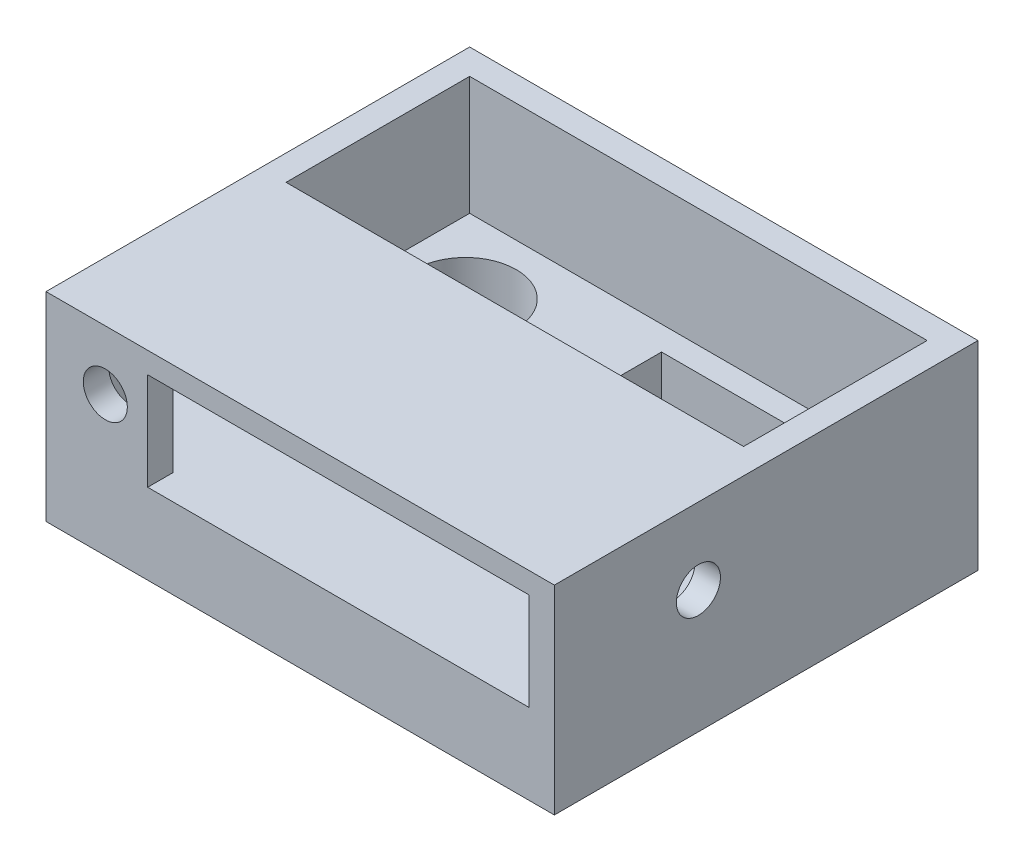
ISO-10303-21;
HEADER;
FILE_DESCRIPTION(('STEP AP214'),'2;1');
FILE_NAME('part.step','',(''),(''),'','','');
FILE_SCHEMA(('AUTOMOTIVE_DESIGN { 1 0 10303 214 1 1 1 1 }'));
ENDSEC;
DATA;
#1=APPLICATION_CONTEXT('core data for automotive mechanical design processes');
#2=APPLICATION_PROTOCOL_DEFINITION('international standard','automotive_design',2000,#1);
#3=PRODUCT_CONTEXT('',#1,'mechanical');
#4=PRODUCT('Part','Part','',(#3));
#5=PRODUCT_RELATED_PRODUCT_CATEGORY('part','',(#4));
#6=PRODUCT_DEFINITION_FORMATION('','',#4);
#7=PRODUCT_DEFINITION_CONTEXT('part definition',#1,'design');
#8=PRODUCT_DEFINITION('design','',#6,#7);
#9=PRODUCT_DEFINITION_SHAPE('','',#8);
#10=(LENGTH_UNIT() NAMED_UNIT(*) SI_UNIT(.MILLI.,.METRE.));
#11=(NAMED_UNIT(*) PLANE_ANGLE_UNIT() SI_UNIT($,.RADIAN.));
#12=(NAMED_UNIT(*) SI_UNIT($,.STERADIAN.) SOLID_ANGLE_UNIT());
#13=UNCERTAINTY_MEASURE_WITH_UNIT(LENGTH_MEASURE(1.E-05),#10,'distance_accuracy_value','');
#14=(GEOMETRIC_REPRESENTATION_CONTEXT(3) GLOBAL_UNCERTAINTY_ASSIGNED_CONTEXT((#13)) GLOBAL_UNIT_ASSIGNED_CONTEXT((#10,
#11,#12)) REPRESENTATION_CONTEXT('',''));
#15=CARTESIAN_POINT('',(0.,0.,0.));
#16=DIRECTION('',(0.,0.,1.));
#17=DIRECTION('',(1.,0.,0.));
#18=AXIS2_PLACEMENT_3D('',#15,#16,#17);
#19=CARTESIAN_POINT('',(0.,0.,0.));
#20=DIRECTION('',(0.,1.,0.));
#21=DIRECTION('',(0.,0.,1.));
#22=AXIS2_PLACEMENT_3D('',#19,#20,#21);
#23=PLANE('',#22);
#24=DIRECTION('',(0.,0.,-1.));
#25=VECTOR('',#24,1.);
#26=CARTESIAN_POINT('',(28.5,0.,5.85000000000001));
#27=LINE('',#26,#25);
#28=CARTESIAN_POINT('',(28.5,0.,18.15));
#29=VERTEX_POINT('',#28);
#30=CARTESIAN_POINT('',(28.5,0.,5.85000000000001));
#31=VERTEX_POINT('',#30);
#32=EDGE_CURVE('E347',#29,#31,#27,.T.);
#33=ORIENTED_EDGE('',*,*,#32,.F.);
#34=DIRECTION('',(-1.,0.,0.));
#35=VECTOR('',#34,1.);
#36=CARTESIAN_POINT('',(56.5,0.,18.15));
#37=LINE('',#36,#35);
#38=CARTESIAN_POINT('',(23.5,0.,18.15));
#39=VERTEX_POINT('',#38);
#40=EDGE_CURVE('E245',#29,#39,#37,.T.);
#41=ORIENTED_EDGE('',*,*,#40,.T.);
#42=DIRECTION('',(0.,0.,-1.));
#43=VECTOR('',#42,1.);
#44=CARTESIAN_POINT('',(23.5,0.,5.85000000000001));
#45=LINE('',#44,#43);
#46=CARTESIAN_POINT('',(23.5,0.,5.85000000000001));
#47=VERTEX_POINT('',#46);
#48=EDGE_CURVE('E257',#39,#47,#45,.T.);
#49=ORIENTED_EDGE('',*,*,#48,.T.);
#50=DIRECTION('',(1.,0.,0.));
#51=VECTOR('',#50,1.);
#52=CARTESIAN_POINT('',(56.5,0.,5.85000000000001));
#53=LINE('',#52,#51);
#54=EDGE_CURVE('E254',#47,#31,#53,.T.);
#55=ORIENTED_EDGE('',*,*,#54,.T.);
#56=EDGE_LOOP('',(#33,#41,#49,#55));
#57=FACE_BOUND('',#56,.T.);
#58=ADVANCED_FACE('F35',(#57),#23,.F.);
#59=CARTESIAN_POINT('',(0.,21.,0.));
#60=DIRECTION('',(1.,0.,0.));
#61=DIRECTION('',(0.,0.,-1.));
#62=AXIS2_PLACEMENT_3D('',#59,#60,#61);
#63=PLANE('',#62);
#64=DIRECTION('',(0.,-1.,0.));
#65=VECTOR('',#64,1.);
#66=CARTESIAN_POINT('',(0.,21.,50.));
#67=LINE('',#66,#65);
#68=CARTESIAN_POINT('',(0.,21.,50.));
#69=VERTEX_POINT('',#68);
#70=CARTESIAN_POINT('',(0.,-2.5,50.));
#71=VERTEX_POINT('',#70);
#72=EDGE_CURVE('E233',#69,#71,#67,.T.);
#73=ORIENTED_EDGE('',*,*,#72,.F.);
#74=DIRECTION('',(0.,0.,1.));
#75=VECTOR('',#74,1.);
#76=CARTESIAN_POINT('',(0.,21.,0.));
#77=LINE('',#76,#75);
#78=CARTESIAN_POINT('',(0.,21.,0.));
#79=VERTEX_POINT('',#78);
#80=EDGE_CURVE('E215',#79,#69,#77,.T.);
#81=ORIENTED_EDGE('',*,*,#80,.F.);
#82=DIRECTION('',(0.,-1.,0.));
#83=VECTOR('',#82,1.);
#84=CARTESIAN_POINT('',(0.,21.,0.));
#85=LINE('',#84,#83);
#86=CARTESIAN_POINT('',(0.,-2.5,0.));
#87=VERTEX_POINT('',#86);
#88=EDGE_CURVE('E227',#79,#87,#85,.T.);
#89=ORIENTED_EDGE('',*,*,#88,.T.);
#90=DIRECTION('',(0.,0.,-1.));
#91=VECTOR('',#90,1.);
#92=CARTESIAN_POINT('',(0.,-2.5,0.));
#93=LINE('',#92,#91);
#94=EDGE_CURVE('E339',#71,#87,#93,.T.);
#95=ORIENTED_EDGE('',*,*,#94,.F.);
#96=EDGE_LOOP('',(#73,#81,#89,#95));
#97=FACE_BOUND('',#96,.T.);
#98=ADVANCED_FACE('F37',(#97),#63,.F.);
#99=CARTESIAN_POINT('',(0.,21.,50.));
#100=DIRECTION('',(0.,0.,-1.));
#101=DIRECTION('',(-1.,0.,0.));
#102=AXIS2_PLACEMENT_3D('',#99,#100,#101);
#103=PLANE('',#102);
#104=DIRECTION('',(-1.,0.,0.));
#105=VECTOR('',#104,1.);
#106=CARTESIAN_POINT('',(57.,18.5,50.));
#107=LINE('',#106,#105);
#108=CARTESIAN_POINT('',(57.,18.5,50.));
#109=VERTEX_POINT('',#108);
#110=CARTESIAN_POINT('',(12.,18.5,50.));
#111=VERTEX_POINT('',#110);
#112=EDGE_CURVE('E289',#109,#111,#107,.T.);
#113=ORIENTED_EDGE('',*,*,#112,.F.);
#114=DIRECTION('',(0.,1.,0.));
#115=VECTOR('',#114,1.);
#116=CARTESIAN_POINT('',(57.,18.5,50.));
#117=LINE('',#116,#115);
#118=CARTESIAN_POINT('',(57.,7.,50.));
#119=VERTEX_POINT('',#118);
#120=EDGE_CURVE('E291',#119,#109,#117,.T.);
#121=ORIENTED_EDGE('',*,*,#120,.F.);
#122=DIRECTION('',(1.,0.,0.));
#123=VECTOR('',#122,1.);
#124=CARTESIAN_POINT('',(57.,7.,50.));
#125=LINE('',#124,#123);
#126=CARTESIAN_POINT('',(12.,7.,50.));
#127=VERTEX_POINT('',#126);
#128=EDGE_CURVE('E189',#127,#119,#125,.T.);
#129=ORIENTED_EDGE('',*,*,#128,.F.);
#130=DIRECTION('',(0.,-1.,0.));
#131=VECTOR('',#130,1.);
#132=CARTESIAN_POINT('',(12.,18.5,50.));
#133=LINE('',#132,#131);
#134=EDGE_CURVE('E173',#111,#127,#133,.T.);
#135=ORIENTED_EDGE('',*,*,#134,.F.);
#136=EDGE_LOOP('',(#113,#121,#129,#135));
#137=FACE_BOUND('',#136,.T.);
#138=CARTESIAN_POINT('',(7.00000000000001,14.,50.));
#139=DIRECTION('',(0.,0.,1.));
#140=DIRECTION('',(1.,0.,0.));
#141=AXIS2_PLACEMENT_3D('',#138,#139,#140);
#142=CIRCLE('',#141,2.6);
#143=CARTESIAN_POINT('',(9.60000000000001,14.,50.));
#144=VERTEX_POINT('',#143);
#145=EDGE_CURVE('E244',#144,#144,#142,.T.);
#146=ORIENTED_EDGE('',*,*,#145,.F.);
#147=EDGE_LOOP('',(#146));
#148=FACE_BOUND('',#147,.T.);
#149=DIRECTION('',(-1.,0.,0.));
#150=VECTOR('',#149,1.);
#151=CARTESIAN_POINT('',(60.,-2.5,50.));
#152=LINE('',#151,#150);
#153=CARTESIAN_POINT('',(60.,-2.5,50.));
#154=VERTEX_POINT('',#153);
#155=EDGE_CURVE('E337',#154,#71,#152,.T.);
#156=ORIENTED_EDGE('',*,*,#155,.F.);
#157=DIRECTION('',(0.,-1.,0.));
#158=VECTOR('',#157,1.);
#159=CARTESIAN_POINT('',(60.,21.,50.));
#160=LINE('',#159,#158);
#161=CARTESIAN_POINT('',(60.,21.,50.));
#162=VERTEX_POINT('',#161);
#163=EDGE_CURVE('E231',#162,#154,#160,.T.);
#164=ORIENTED_EDGE('',*,*,#163,.F.);
#165=DIRECTION('',(1.,0.,0.));
#166=VECTOR('',#165,1.);
#167=CARTESIAN_POINT('',(0.,21.,50.));
#168=LINE('',#167,#166);
#169=EDGE_CURVE('E221',#69,#162,#168,.T.);
#170=ORIENTED_EDGE('',*,*,#169,.F.);
#171=ORIENTED_EDGE('',*,*,#72,.T.);
#172=EDGE_LOOP('',(#156,#164,#170,#171));
#173=FACE_BOUND('',#172,.T.);
#174=ADVANCED_FACE('F400',(#137,#148,#173),#103,.F.);
#175=CARTESIAN_POINT('',(60.,21.,0.));
#176=DIRECTION('',(-1.,0.,0.));
#177=DIRECTION('',(0.,0.,1.));
#178=AXIS2_PLACEMENT_3D('',#175,#176,#177);
#179=PLANE('',#178);
#180=CARTESIAN_POINT('',(60.,12.,33.));
#181=DIRECTION('',(1.,0.,0.));
#182=DIRECTION('',(0.,0.,-1.));
#183=AXIS2_PLACEMENT_3D('',#180,#181,#182);
#184=CIRCLE('',#183,2.6);
#185=CARTESIAN_POINT('',(60.,12.,30.4));
#186=VERTEX_POINT('',#185);
#187=EDGE_CURVE('E240',#186,#186,#184,.T.);
#188=ORIENTED_EDGE('',*,*,#187,.F.);
#189=EDGE_LOOP('',(#188));
#190=FACE_BOUND('',#189,.T.);
#191=DIRECTION('',(0.,-1.,0.));
#192=VECTOR('',#191,1.);
#193=CARTESIAN_POINT('',(60.,21.,0.));
#194=LINE('',#193,#192);
#195=CARTESIAN_POINT('',(60.,21.,0.));
#196=VERTEX_POINT('',#195);
#197=CARTESIAN_POINT('',(60.,-2.5,0.));
#198=VERTEX_POINT('',#197);
#199=EDGE_CURVE('E229',#196,#198,#194,.T.);
#200=ORIENTED_EDGE('',*,*,#199,.F.);
#201=DIRECTION('',(0.,0.,-1.));
#202=VECTOR('',#201,1.);
#203=CARTESIAN_POINT('',(60.,21.,0.));
#204=LINE('',#203,#202);
#205=EDGE_CURVE('E223',#162,#196,#204,.T.);
#206=ORIENTED_EDGE('',*,*,#205,.F.);
#207=ORIENTED_EDGE('',*,*,#163,.T.);
#208=DIRECTION('',(0.,0.,1.));
#209=VECTOR('',#208,1.);
#210=CARTESIAN_POINT('',(60.,-2.5,0.));
#211=LINE('',#210,#209);
#212=EDGE_CURVE('E314',#198,#154,#211,.T.);
#213=ORIENTED_EDGE('',*,*,#212,.F.);
#214=EDGE_LOOP('',(#200,#206,#207,#213));
#215=FACE_BOUND('',#214,.T.);
#216=ADVANCED_FACE('F419',(#190,#215),#179,.F.);
#217=CARTESIAN_POINT('',(0.,21.,0.));
#218=DIRECTION('',(0.,0.,1.));
#219=DIRECTION('',(1.,0.,0.));
#220=AXIS2_PLACEMENT_3D('',#217,#218,#219);
#221=PLANE('',#220);
#222=ORIENTED_EDGE('',*,*,#199,.T.);
#223=DIRECTION('',(1.,0.,0.));
#224=VECTOR('',#223,1.);
#225=CARTESIAN_POINT('',(60.,-2.5,0.));
#226=LINE('',#225,#224);
#227=EDGE_CURVE('E342',#87,#198,#226,.T.);
#228=ORIENTED_EDGE('',*,*,#227,.F.);
#229=ORIENTED_EDGE('',*,*,#88,.F.);
#230=DIRECTION('',(-1.,0.,0.));
#231=VECTOR('',#230,1.);
#232=CARTESIAN_POINT('',(0.,21.,0.));
#233=LINE('',#232,#231);
#234=EDGE_CURVE('E225',#196,#79,#233,.T.);
#235=ORIENTED_EDGE('',*,*,#234,.F.);
#236=EDGE_LOOP('',(#222,#228,#229,#235));
#237=FACE_BOUND('',#236,.T.);
#238=ADVANCED_FACE('F414',(#237),#221,.F.);
#239=CARTESIAN_POINT('',(0.,21.,0.));
#240=DIRECTION('',(0.,1.,0.));
#241=DIRECTION('',(0.,0.,1.));
#242=AXIS2_PLACEMENT_3D('',#239,#240,#241);
#243=PLANE('',#242);
#244=DIRECTION('',(0.,0.,-1.));
#245=VECTOR('',#244,1.);
#246=CARTESIAN_POINT('',(57.,21.,3.));
#247=LINE('',#246,#245);
#248=CARTESIAN_POINT('',(57.,21.,24.6679048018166));
#249=VERTEX_POINT('',#248);
#250=CARTESIAN_POINT('',(57.,21.,3.));
#251=VERTEX_POINT('',#250);
#252=EDGE_CURVE('E208',#249,#251,#247,.T.);
#253=ORIENTED_EDGE('',*,*,#252,.F.);
#254=DIRECTION('',(-1.,0.,0.));
#255=VECTOR('',#254,1.);
#256=CARTESIAN_POINT('',(0.,21.,24.6679048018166));
#257=LINE('',#256,#255);
#258=CARTESIAN_POINT('',(3.,21.,24.6679048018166));
#259=VERTEX_POINT('',#258);
#260=EDGE_CURVE('E178',#249,#259,#257,.T.);
#261=ORIENTED_EDGE('',*,*,#260,.T.);
#262=DIRECTION('',(0.,0.,1.));
#263=VECTOR('',#262,1.);
#264=CARTESIAN_POINT('',(3.,21.,3.));
#265=LINE('',#264,#263);
#266=CARTESIAN_POINT('',(3.,21.,3.));
#267=VERTEX_POINT('',#266);
#268=EDGE_CURVE('E206',#267,#259,#265,.T.);
#269=ORIENTED_EDGE('',*,*,#268,.F.);
#270=DIRECTION('',(-1.,0.,0.));
#271=VECTOR('',#270,1.);
#272=CARTESIAN_POINT('',(3.,21.,3.));
#273=LINE('',#272,#271);
#274=EDGE_CURVE('E200',#251,#267,#273,.T.);
#275=ORIENTED_EDGE('',*,*,#274,.F.);
#276=EDGE_LOOP('',(#253,#261,#269,#275));
#277=FACE_BOUND('',#276,.T.);
#278=ORIENTED_EDGE('',*,*,#205,.T.);
#279=ORIENTED_EDGE('',*,*,#234,.T.);
#280=ORIENTED_EDGE('',*,*,#80,.T.);
#281=ORIENTED_EDGE('',*,*,#169,.T.);
#282=EDGE_LOOP('',(#278,#279,#280,#281));
#283=FACE_BOUND('',#282,.T.);
#284=ADVANCED_FACE('F406',(#277,#283),#243,.T.);
#285=DIRECTION('',(0.,0.,1.));
#286=VECTOR('',#285,1.);
#287=CARTESIAN_POINT('',(56.5,0.,5.85000000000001));
#288=LINE('',#287,#286);
#289=CARTESIAN_POINT('',(56.5,0.,5.85000000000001));
#290=VERTEX_POINT('',#289);
#291=CARTESIAN_POINT('',(56.5,0.,18.15));
#292=VERTEX_POINT('',#291);
#293=EDGE_CURVE('E243',#290,#292,#288,.T.);
#294=ORIENTED_EDGE('',*,*,#293,.T.);
#295=CARTESIAN_POINT('',(51.5,0.,18.15));
#296=VERTEX_POINT('',#295);
#297=EDGE_CURVE('E248',#292,#296,#37,.T.);
#298=ORIENTED_EDGE('',*,*,#297,.T.);
#299=DIRECTION('',(0.,0.,1.));
#300=VECTOR('',#299,1.);
#301=CARTESIAN_POINT('',(51.5,0.,5.85));
#302=LINE('',#301,#300);
#303=CARTESIAN_POINT('',(51.5,0.,5.85000000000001));
#304=VERTEX_POINT('',#303);
#305=EDGE_CURVE('E239',#304,#296,#302,.T.);
#306=ORIENTED_EDGE('',*,*,#305,.F.);
#307=EDGE_CURVE('E235',#304,#290,#53,.T.);
#308=ORIENTED_EDGE('',*,*,#307,.T.);
#309=EDGE_LOOP('',(#294,#298,#306,#308));
#310=FACE_BOUND('',#309,.T.);
#311=ADVANCED_FACE('F396',(#310),#23,.F.);
#312=CARTESIAN_POINT('',(3.,7.,3.));
#313=DIRECTION('',(-1.,0.,0.));
#314=DIRECTION('',(0.,0.,1.));
#315=AXIS2_PLACEMENT_3D('',#312,#313,#314);
#316=PLANE('',#315);
#317=ORIENTED_EDGE('',*,*,#268,.T.);
#318=DIRECTION('',(0.,-1.,0.));
#319=VECTOR('',#318,1.);
#320=CARTESIAN_POINT('',(3.,7.,24.6679048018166));
#321=LINE('',#320,#319);
#322=CARTESIAN_POINT('',(3.,18.5,24.6679048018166));
#323=VERTEX_POINT('',#322);
#324=EDGE_CURVE('E276',#259,#323,#321,.T.);
#325=ORIENTED_EDGE('',*,*,#324,.T.);
#326=DIRECTION('',(0.,0.,1.));
#327=VECTOR('',#326,1.);
#328=CARTESIAN_POINT('',(3.,18.5,3.));
#329=LINE('',#328,#327);
#330=CARTESIAN_POINT('',(3.00000000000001,18.5,47.));
#331=VERTEX_POINT('',#330);
#332=EDGE_CURVE('E278',#323,#331,#329,.T.);
#333=ORIENTED_EDGE('',*,*,#332,.T.);
#334=DIRECTION('',(0.,1.,0.));
#335=VECTOR('',#334,1.);
#336=CARTESIAN_POINT('',(3.00000000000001,7.,47.));
#337=LINE('',#336,#335);
#338=CARTESIAN_POINT('',(3.00000000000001,7.,47.));
#339=VERTEX_POINT('',#338);
#340=EDGE_CURVE('E205',#339,#331,#337,.T.);
#341=ORIENTED_EDGE('',*,*,#340,.F.);
#342=DIRECTION('',(0.,0.,1.));
#343=VECTOR('',#342,1.);
#344=CARTESIAN_POINT('',(3.,7.,3.));
#345=LINE('',#344,#343);
#346=CARTESIAN_POINT('',(3.,7.,3.));
#347=VERTEX_POINT('',#346);
#348=EDGE_CURVE('E194',#347,#339,#345,.T.);
#349=ORIENTED_EDGE('',*,*,#348,.F.);
#350=DIRECTION('',(0.,1.,0.));
#351=VECTOR('',#350,1.);
#352=CARTESIAN_POINT('',(3.,7.,3.));
#353=LINE('',#352,#351);
#354=EDGE_CURVE('E213',#347,#267,#353,.T.);
#355=ORIENTED_EDGE('',*,*,#354,.T.);
#356=EDGE_LOOP('',(#317,#325,#333,#341,#349,#355));
#357=FACE_BOUND('',#356,.T.);
#358=ADVANCED_FACE('F405',(#357),#316,.F.);
#359=CARTESIAN_POINT('',(3.,7.,3.));
#360=DIRECTION('',(0.,0.,-1.));
#361=DIRECTION('',(-1.,0.,0.));
#362=AXIS2_PLACEMENT_3D('',#359,#360,#361);
#363=PLANE('',#362);
#364=ORIENTED_EDGE('',*,*,#274,.T.);
#365=ORIENTED_EDGE('',*,*,#354,.F.);
#366=DIRECTION('',(-1.,0.,0.));
#367=VECTOR('',#366,1.);
#368=CARTESIAN_POINT('',(3.,7.,3.));
#369=LINE('',#368,#367);
#370=CARTESIAN_POINT('',(57.,7.,3.));
#371=VERTEX_POINT('',#370);
#372=EDGE_CURVE('E198',#371,#347,#369,.T.);
#373=ORIENTED_EDGE('',*,*,#372,.F.);
#374=DIRECTION('',(0.,1.,0.));
#375=VECTOR('',#374,1.);
#376=CARTESIAN_POINT('',(57.,7.,3.));
#377=LINE('',#376,#375);
#378=EDGE_CURVE('E216',#371,#251,#377,.T.);
#379=ORIENTED_EDGE('',*,*,#378,.T.);
#380=EDGE_LOOP('',(#364,#365,#373,#379));
#381=FACE_BOUND('',#380,.T.);
#382=ADVANCED_FACE('F411',(#381),#363,.F.);
#383=CARTESIAN_POINT('',(57.,7.,3.));
#384=DIRECTION('',(1.,0.,0.));
#385=DIRECTION('',(0.,0.,-1.));
#386=AXIS2_PLACEMENT_3D('',#383,#384,#385);
#387=PLANE('',#386);
#388=CARTESIAN_POINT('',(57.,12.,33.));
#389=DIRECTION('',(1.,0.,0.));
#390=DIRECTION('',(0.,0.,-1.));
#391=AXIS2_PLACEMENT_3D('',#388,#389,#390);
#392=CIRCLE('',#391,2.6);
#393=CARTESIAN_POINT('',(57.,12.,30.4));
#394=VERTEX_POINT('',#393);
#395=EDGE_CURVE('E236',#394,#394,#392,.T.);
#396=ORIENTED_EDGE('',*,*,#395,.T.);
#397=EDGE_LOOP('',(#396));
#398=FACE_BOUND('',#397,.T.);
#399=DIRECTION('',(0.,0.,-1.));
#400=VECTOR('',#399,1.);
#401=CARTESIAN_POINT('',(57.,18.5,3.));
#402=LINE('',#401,#400);
#403=CARTESIAN_POINT('',(57.,18.5,24.6679048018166));
#404=VERTEX_POINT('',#403);
#405=EDGE_CURVE('E50',#109,#404,#402,.T.);
#406=ORIENTED_EDGE('',*,*,#405,.T.);
#407=DIRECTION('',(0.,1.,0.));
#408=VECTOR('',#407,1.);
#409=CARTESIAN_POINT('',(57.,7.,24.6679048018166));
#410=LINE('',#409,#408);
#411=EDGE_CURVE('E11',#404,#249,#410,.T.);
#412=ORIENTED_EDGE('',*,*,#411,.T.);
#413=ORIENTED_EDGE('',*,*,#252,.T.);
#414=ORIENTED_EDGE('',*,*,#378,.F.);
#415=DIRECTION('',(0.,0.,-1.));
#416=VECTOR('',#415,1.);
#417=CARTESIAN_POINT('',(57.,7.,3.));
#418=LINE('',#417,#416);
#419=EDGE_CURVE('E195',#119,#371,#418,.T.);
#420=ORIENTED_EDGE('',*,*,#419,.F.);
#421=ORIENTED_EDGE('',*,*,#120,.T.);
#422=EDGE_LOOP('',(#406,#412,#413,#414,#420,#421));
#423=FACE_BOUND('',#422,.T.);
#424=ADVANCED_FACE('F426',(#398,#423),#387,.F.);
#425=CARTESIAN_POINT('',(3.00000000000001,7.,47.));
#426=DIRECTION('',(0.,0.,1.));
#427=DIRECTION('',(1.,0.,0.));
#428=AXIS2_PLACEMENT_3D('',#425,#426,#427);
#429=PLANE('',#428);
#430=CARTESIAN_POINT('',(7.00000000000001,14.,47.));
#431=DIRECTION('',(0.,0.,1.));
#432=DIRECTION('',(1.,0.,0.));
#433=AXIS2_PLACEMENT_3D('',#430,#431,#432);
#434=CIRCLE('',#433,2.6);
#435=CARTESIAN_POINT('',(9.60000000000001,14.,47.));
#436=VERTEX_POINT('',#435);
#437=EDGE_CURVE('E241',#436,#436,#434,.T.);
#438=ORIENTED_EDGE('',*,*,#437,.T.);
#439=EDGE_LOOP('',(#438));
#440=FACE_BOUND('',#439,.T.);
#441=DIRECTION('',(1.,0.,0.));
#442=VECTOR('',#441,1.);
#443=CARTESIAN_POINT('',(3.00000000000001,18.5,47.));
#444=LINE('',#443,#442);
#445=CARTESIAN_POINT('',(12.,18.5,47.));
#446=VERTEX_POINT('',#445);
#447=EDGE_CURVE('E43',#331,#446,#444,.T.);
#448=ORIENTED_EDGE('',*,*,#447,.T.);
#449=DIRECTION('',(0.,-1.,0.));
#450=VECTOR('',#449,1.);
#451=CARTESIAN_POINT('',(12.,18.5,47.));
#452=LINE('',#451,#450);
#453=CARTESIAN_POINT('',(12.,7.,47.));
#454=VERTEX_POINT('',#453);
#455=EDGE_CURVE('E58',#446,#454,#452,.T.);
#456=ORIENTED_EDGE('',*,*,#455,.T.);
#457=DIRECTION('',(1.,0.,0.));
#458=VECTOR('',#457,1.);
#459=CARTESIAN_POINT('',(3.00000000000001,7.,47.));
#460=LINE('',#459,#458);
#461=EDGE_CURVE('E186',#339,#454,#460,.T.);
#462=ORIENTED_EDGE('',*,*,#461,.F.);
#463=ORIENTED_EDGE('',*,*,#340,.T.);
#464=EDGE_LOOP('',(#448,#456,#462,#463));
#465=FACE_BOUND('',#464,.T.);
#466=ADVANCED_FACE('F184',(#440,#465),#429,.F.);
#467=CARTESIAN_POINT('',(0.,7.,0.));
#468=DIRECTION('',(0.,1.,0.));
#469=DIRECTION('',(0.,0.,1.));
#470=AXIS2_PLACEMENT_3D('',#467,#468,#469);
#471=PLANE('',#470);
#472=CARTESIAN_POINT('',(11.5,7.,12.));
#473=DIRECTION('',(0.,1.,0.));
#474=DIRECTION('',(0.,0.,1.));
#475=AXIS2_PLACEMENT_3D('',#472,#473,#474);
#476=CIRCLE('',#475,6.);
#477=CARTESIAN_POINT('',(11.5,7.,18.));
#478=VERTEX_POINT('',#477);
#479=EDGE_CURVE('E292',#478,#478,#476,.F.);
#480=ORIENTED_EDGE('',*,*,#479,.T.);
#481=EDGE_LOOP('',(#480));
#482=FACE_BOUND('',#481,.T.);
#483=DIRECTION('',(0.,0.,1.));
#484=VECTOR('',#483,1.);
#485=CARTESIAN_POINT('',(28.5,7.,5.85000000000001));
#486=LINE('',#485,#484);
#487=CARTESIAN_POINT('',(28.5,7.,5.85000000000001));
#488=VERTEX_POINT('',#487);
#489=CARTESIAN_POINT('',(28.5,7.,18.15));
#490=VERTEX_POINT('',#489);
#491=EDGE_CURVE('E350',#488,#490,#486,.T.);
#492=ORIENTED_EDGE('',*,*,#491,.F.);
#493=DIRECTION('',(-1.,0.,0.));
#494=VECTOR('',#493,1.);
#495=CARTESIAN_POINT('',(28.5,7.,5.85000000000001));
#496=LINE('',#495,#494);
#497=CARTESIAN_POINT('',(51.5,7.,5.85));
#498=VERTEX_POINT('',#497);
#499=EDGE_CURVE('E358',#498,#488,#496,.T.);
#500=ORIENTED_EDGE('',*,*,#499,.F.);
#501=DIRECTION('',(0.,0.,-1.));
#502=VECTOR('',#501,1.);
#503=CARTESIAN_POINT('',(51.5,7.,5.85));
#504=LINE('',#503,#502);
#505=CARTESIAN_POINT('',(51.5,7.,18.15));
#506=VERTEX_POINT('',#505);
#507=EDGE_CURVE('E355',#506,#498,#504,.T.);
#508=ORIENTED_EDGE('',*,*,#507,.F.);
#509=DIRECTION('',(1.,0.,0.));
#510=VECTOR('',#509,1.);
#511=CARTESIAN_POINT('',(28.5,7.,18.15));
#512=LINE('',#511,#510);
#513=EDGE_CURVE('E352',#490,#506,#512,.T.);
#514=ORIENTED_EDGE('',*,*,#513,.F.);
#515=EDGE_LOOP('',(#492,#500,#508,#514));
#516=FACE_BOUND('',#515,.T.);
#517=ORIENTED_EDGE('',*,*,#348,.T.);
#518=ORIENTED_EDGE('',*,*,#461,.T.);
#519=DIRECTION('',(0.,0.,1.));
#520=VECTOR('',#519,1.);
#521=CARTESIAN_POINT('',(12.,7.,47.));
#522=LINE('',#521,#520);
#523=EDGE_CURVE('E170',#454,#127,#522,.T.);
#524=ORIENTED_EDGE('',*,*,#523,.T.);
#525=ORIENTED_EDGE('',*,*,#128,.T.);
#526=ORIENTED_EDGE('',*,*,#419,.T.);
#527=ORIENTED_EDGE('',*,*,#372,.T.);
#528=EDGE_LOOP('',(#517,#518,#524,#525,#526,#527));
#529=FACE_BOUND('',#528,.T.);
#530=ADVANCED_FACE('F191',(#482,#516,#529),#471,.T.);
#531=CARTESIAN_POINT('',(28.5,-0.00100000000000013,5.85000000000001));
#532=DIRECTION('',(-1.,0.,0.));
#533=DIRECTION('',(0.,0.,1.));
#534=AXIS2_PLACEMENT_3D('',#531,#532,#533);
#535=PLANE('',#534);
#536=ORIENTED_EDGE('',*,*,#32,.T.);
#537=DIRECTION('',(0.,1.,0.));
#538=VECTOR('',#537,1.);
#539=CARTESIAN_POINT('',(28.5,-0.00100000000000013,5.85000000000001));
#540=LINE('',#539,#538);
#541=EDGE_CURVE('E209',#31,#488,#540,.T.);
#542=ORIENTED_EDGE('',*,*,#541,.T.);
#543=ORIENTED_EDGE('',*,*,#491,.T.);
#544=DIRECTION('',(0.,1.,0.));
#545=VECTOR('',#544,1.);
#546=CARTESIAN_POINT('',(28.5,-0.00100000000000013,18.15));
#547=LINE('',#546,#545);
#548=EDGE_CURVE('E361',#29,#490,#547,.T.);
#549=ORIENTED_EDGE('',*,*,#548,.F.);
#550=EDGE_LOOP('',(#536,#542,#543,#549));
#551=FACE_BOUND('',#550,.T.);
#552=ADVANCED_FACE('F383',(#551),#535,.F.);
#553=CARTESIAN_POINT('',(28.5,-0.00100000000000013,5.85000000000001));
#554=DIRECTION('',(0.,0.,-1.));
#555=DIRECTION('',(-1.,0.,0.));
#556=AXIS2_PLACEMENT_3D('',#553,#554,#555);
#557=PLANE('',#556);
#558=ORIENTED_EDGE('',*,*,#541,.F.);
#559=ORIENTED_EDGE('',*,*,#54,.F.);
#560=DIRECTION('',(0.,1.,0.));
#561=VECTOR('',#560,1.);
#562=CARTESIAN_POINT('',(23.5,-2.5,5.85000000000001));
#563=LINE('',#562,#561);
#564=CARTESIAN_POINT('',(23.5,-2.5,5.85000000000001));
#565=VERTEX_POINT('',#564);
#566=EDGE_CURVE('E330',#565,#47,#563,.T.);
#567=ORIENTED_EDGE('',*,*,#566,.F.);
#568=DIRECTION('',(1.,0.,0.));
#569=VECTOR('',#568,1.);
#570=CARTESIAN_POINT('',(56.5,-2.5,5.85000000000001));
#571=LINE('',#570,#569);
#572=CARTESIAN_POINT('',(56.5,-2.5,5.85000000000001));
#573=VERTEX_POINT('',#572);
#574=EDGE_CURVE('E264',#565,#573,#571,.T.);
#575=ORIENTED_EDGE('',*,*,#574,.T.);
#576=DIRECTION('',(0.,1.,0.));
#577=VECTOR('',#576,1.);
#578=CARTESIAN_POINT('',(56.5,-2.5,5.85000000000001));
#579=LINE('',#578,#577);
#580=EDGE_CURVE('E266',#573,#290,#579,.T.);
#581=ORIENTED_EDGE('',*,*,#580,.T.);
#582=ORIENTED_EDGE('',*,*,#307,.F.);
#583=DIRECTION('',(0.,1.,0.));
#584=VECTOR('',#583,1.);
#585=CARTESIAN_POINT('',(51.5,-0.00100000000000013,5.85));
#586=LINE('',#585,#584);
#587=EDGE_CURVE('E363',#304,#498,#586,.T.);
#588=ORIENTED_EDGE('',*,*,#587,.T.);
#589=ORIENTED_EDGE('',*,*,#499,.T.);
#590=EDGE_LOOP('',(#558,#559,#567,#575,#581,#582,#588,#589));
#591=FACE_BOUND('',#590,.T.);
#592=ADVANCED_FACE('F382',(#591),#557,.F.);
#593=CARTESIAN_POINT('',(51.5,-0.00100000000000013,5.85));
#594=DIRECTION('',(1.,0.,0.));
#595=DIRECTION('',(0.,0.,-1.));
#596=AXIS2_PLACEMENT_3D('',#593,#594,#595);
#597=PLANE('',#596);
#598=ORIENTED_EDGE('',*,*,#305,.T.);
#599=DIRECTION('',(0.,1.,0.));
#600=VECTOR('',#599,1.);
#601=CARTESIAN_POINT('',(51.5,-0.00100000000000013,18.15));
#602=LINE('',#601,#600);
#603=EDGE_CURVE('E365',#296,#506,#602,.T.);
#604=ORIENTED_EDGE('',*,*,#603,.T.);
#605=ORIENTED_EDGE('',*,*,#507,.T.);
#606=ORIENTED_EDGE('',*,*,#587,.F.);
#607=EDGE_LOOP('',(#598,#604,#605,#606));
#608=FACE_BOUND('',#607,.T.);
#609=ADVANCED_FACE('F376',(#608),#597,.F.);
#610=CARTESIAN_POINT('',(28.5,-0.00100000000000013,18.15));
#611=DIRECTION('',(0.,0.,1.));
#612=DIRECTION('',(1.,0.,0.));
#613=AXIS2_PLACEMENT_3D('',#610,#611,#612);
#614=PLANE('',#613);
#615=ORIENTED_EDGE('',*,*,#603,.F.);
#616=ORIENTED_EDGE('',*,*,#297,.F.);
#617=DIRECTION('',(0.,1.,0.));
#618=VECTOR('',#617,1.);
#619=CARTESIAN_POINT('',(56.5,-2.5,18.15));
#620=LINE('',#619,#618);
#621=CARTESIAN_POINT('',(56.5,-2.5,18.15));
#622=VERTEX_POINT('',#621);
#623=EDGE_CURVE('E327',#622,#292,#620,.T.);
#624=ORIENTED_EDGE('',*,*,#623,.F.);
#625=DIRECTION('',(-1.,0.,0.));
#626=VECTOR('',#625,1.);
#627=CARTESIAN_POINT('',(56.5,-2.5,18.15));
#628=LINE('',#627,#626);
#629=CARTESIAN_POINT('',(23.5,-2.5,18.15));
#630=VERTEX_POINT('',#629);
#631=EDGE_CURVE('E270',#622,#630,#628,.T.);
#632=ORIENTED_EDGE('',*,*,#631,.T.);
#633=DIRECTION('',(0.,1.,0.));
#634=VECTOR('',#633,1.);
#635=CARTESIAN_POINT('',(23.5,-2.5,18.15));
#636=LINE('',#635,#634);
#637=EDGE_CURVE('E324',#630,#39,#636,.T.);
#638=ORIENTED_EDGE('',*,*,#637,.T.);
#639=ORIENTED_EDGE('',*,*,#40,.F.);
#640=ORIENTED_EDGE('',*,*,#548,.T.);
#641=ORIENTED_EDGE('',*,*,#513,.T.);
#642=EDGE_LOOP('',(#615,#616,#624,#632,#638,#639,#640,#641));
#643=FACE_BOUND('',#642,.T.);
#644=ADVANCED_FACE('F323',(#643),#614,.F.);
#645=CARTESIAN_POINT('',(50.,12.,33.));
#646=DIRECTION('',(1.,0.,0.));
#647=DIRECTION('',(0.,0.,-1.));
#648=AXIS2_PLACEMENT_3D('',#645,#646,#647);
#649=CYLINDRICAL_SURFACE('',#648,2.6);
#650=ORIENTED_EDGE('',*,*,#187,.T.);
#651=EDGE_LOOP('',(#650));
#652=FACE_BOUND('',#651,.T.);
#653=ORIENTED_EDGE('',*,*,#395,.F.);
#654=EDGE_LOOP('',(#653));
#655=FACE_BOUND('',#654,.T.);
#656=ADVANCED_FACE('F307',(#652,#655),#649,.F.);
#657=CARTESIAN_POINT('',(0.,-2.5,0.));
#658=DIRECTION('',(0.,-1.,0.));
#659=DIRECTION('',(0.,0.,-1.));
#660=AXIS2_PLACEMENT_3D('',#657,#658,#659);
#661=PLANE('',#660);
#662=CARTESIAN_POINT('',(11.5,-2.5,12.));
#663=DIRECTION('',(0.,-1.,0.));
#664=DIRECTION('',(0.,0.,-1.));
#665=AXIS2_PLACEMENT_3D('',#662,#663,#664);
#666=CIRCLE('',#665,6.);
#667=CARTESIAN_POINT('',(11.5,-2.5,6.));
#668=VERTEX_POINT('',#667);
#669=EDGE_CURVE('E296',#668,#668,#666,.T.);
#670=ORIENTED_EDGE('',*,*,#669,.F.);
#671=EDGE_LOOP('',(#670));
#672=FACE_BOUND('',#671,.T.);
#673=ORIENTED_EDGE('',*,*,#212,.T.);
#674=ORIENTED_EDGE('',*,*,#155,.T.);
#675=ORIENTED_EDGE('',*,*,#94,.T.);
#676=ORIENTED_EDGE('',*,*,#227,.T.);
#677=EDGE_LOOP('',(#673,#674,#675,#676));
#678=FACE_BOUND('',#677,.T.);
#679=ORIENTED_EDGE('',*,*,#631,.F.);
#680=DIRECTION('',(0.,0.,1.));
#681=VECTOR('',#680,1.);
#682=CARTESIAN_POINT('',(56.5,-2.5,5.85000000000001));
#683=LINE('',#682,#681);
#684=EDGE_CURVE('E272',#573,#622,#683,.T.);
#685=ORIENTED_EDGE('',*,*,#684,.F.);
#686=ORIENTED_EDGE('',*,*,#574,.F.);
#687=DIRECTION('',(0.,0.,-1.));
#688=VECTOR('',#687,1.);
#689=CARTESIAN_POINT('',(23.5,-2.5,5.85000000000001));
#690=LINE('',#689,#688);
#691=EDGE_CURVE('E267',#630,#565,#690,.T.);
#692=ORIENTED_EDGE('',*,*,#691,.F.);
#693=EDGE_LOOP('',(#679,#685,#686,#692));
#694=FACE_BOUND('',#693,.T.);
#695=ADVANCED_FACE('F303',(#672,#678,#694),#661,.T.);
#696=CARTESIAN_POINT('',(56.5,-2.5,5.85000000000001));
#697=DIRECTION('',(-1.,0.,0.));
#698=DIRECTION('',(0.,0.,1.));
#699=AXIS2_PLACEMENT_3D('',#696,#697,#698);
#700=PLANE('',#699);
#701=ORIENTED_EDGE('',*,*,#293,.F.);
#702=ORIENTED_EDGE('',*,*,#580,.F.);
#703=ORIENTED_EDGE('',*,*,#684,.T.);
#704=ORIENTED_EDGE('',*,*,#623,.T.);
#705=EDGE_LOOP('',(#701,#702,#703,#704));
#706=FACE_BOUND('',#705,.T.);
#707=ADVANCED_FACE('F306',(#706),#700,.T.);
#708=CARTESIAN_POINT('',(23.5,-2.5,5.85000000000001));
#709=DIRECTION('',(1.,0.,0.));
#710=DIRECTION('',(0.,0.,-1.));
#711=AXIS2_PLACEMENT_3D('',#708,#709,#710);
#712=PLANE('',#711);
#713=ORIENTED_EDGE('',*,*,#48,.F.);
#714=ORIENTED_EDGE('',*,*,#637,.F.);
#715=ORIENTED_EDGE('',*,*,#691,.T.);
#716=ORIENTED_EDGE('',*,*,#566,.T.);
#717=EDGE_LOOP('',(#713,#714,#715,#716));
#718=FACE_BOUND('',#717,.T.);
#719=ADVANCED_FACE('F329',(#718),#712,.T.);
#720=CARTESIAN_POINT('',(7.00000000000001,14.,40.));
#721=DIRECTION('',(0.,0.,1.));
#722=DIRECTION('',(1.,0.,0.));
#723=AXIS2_PLACEMENT_3D('',#720,#721,#722);
#724=CYLINDRICAL_SURFACE('',#723,2.6);
#725=ORIENTED_EDGE('',*,*,#145,.T.);
#726=EDGE_LOOP('',(#725));
#727=FACE_BOUND('',#726,.T.);
#728=ORIENTED_EDGE('',*,*,#437,.F.);
#729=EDGE_LOOP('',(#728));
#730=FACE_BOUND('',#729,.T.);
#731=ADVANCED_FACE('F509',(#727,#730),#724,.F.);
#732=CARTESIAN_POINT('',(0.,18.5,24.6679048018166));
#733=DIRECTION('',(0.,0.,-1.));
#734=DIRECTION('',(-1.,0.,0.));
#735=AXIS2_PLACEMENT_3D('',#732,#733,#734);
#736=PLANE('',#735);
#737=ORIENTED_EDGE('',*,*,#324,.F.);
#738=ORIENTED_EDGE('',*,*,#260,.F.);
#739=ORIENTED_EDGE('',*,*,#411,.F.);
#740=DIRECTION('',(-1.,0.,0.));
#741=VECTOR('',#740,1.);
#742=CARTESIAN_POINT('',(0.,18.5,24.6679048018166));
#743=LINE('',#742,#741);
#744=EDGE_CURVE('E281',#404,#323,#743,.T.);
#745=ORIENTED_EDGE('',*,*,#744,.T.);
#746=EDGE_LOOP('',(#737,#738,#739,#745));
#747=FACE_BOUND('',#746,.T.);
#748=ADVANCED_FACE('F442',(#747),#736,.T.);
#749=CARTESIAN_POINT('',(0.,18.5,0.));
#750=DIRECTION('',(0.,-1.,0.));
#751=DIRECTION('',(0.,0.,-1.));
#752=AXIS2_PLACEMENT_3D('',#749,#750,#751);
#753=PLANE('',#752);
#754=ORIENTED_EDGE('',*,*,#332,.F.);
#755=ORIENTED_EDGE('',*,*,#744,.F.);
#756=ORIENTED_EDGE('',*,*,#405,.F.);
#757=ORIENTED_EDGE('',*,*,#112,.T.);
#758=DIRECTION('',(0.,0.,1.));
#759=VECTOR('',#758,1.);
#760=CARTESIAN_POINT('',(12.,18.5,47.));
#761=LINE('',#760,#759);
#762=EDGE_CURVE('E179',#446,#111,#761,.T.);
#763=ORIENTED_EDGE('',*,*,#762,.F.);
#764=ORIENTED_EDGE('',*,*,#447,.F.);
#765=EDGE_LOOP('',(#754,#755,#756,#757,#763,#764));
#766=FACE_BOUND('',#765,.T.);
#767=ADVANCED_FACE('F444',(#766),#753,.T.);
#768=CARTESIAN_POINT('',(12.,18.5,47.));
#769=DIRECTION('',(-1.,0.,0.));
#770=DIRECTION('',(0.,-1.,0.));
#771=AXIS2_PLACEMENT_3D('',#768,#769,#770);
#772=PLANE('',#771);
#773=ORIENTED_EDGE('',*,*,#134,.T.);
#774=ORIENTED_EDGE('',*,*,#523,.F.);
#775=ORIENTED_EDGE('',*,*,#455,.F.);
#776=ORIENTED_EDGE('',*,*,#762,.T.);
#777=EDGE_LOOP('',(#773,#774,#775,#776));
#778=FACE_BOUND('',#777,.T.);
#779=ADVANCED_FACE('F171',(#778),#772,.F.);
#780=CARTESIAN_POINT('',(11.5,23.9705627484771,12.));
#781=DIRECTION('',(0.,-1.,0.));
#782=DIRECTION('',(0.,0.,-1.));
#783=AXIS2_PLACEMENT_3D('',#780,#781,#782);
#784=CYLINDRICAL_SURFACE('',#783,6.);
#785=ORIENTED_EDGE('',*,*,#669,.T.);
#786=EDGE_LOOP('',(#785));
#787=FACE_BOUND('',#786,.T.);
#788=ORIENTED_EDGE('',*,*,#479,.F.);
#789=EDGE_LOOP('',(#788));
#790=FACE_BOUND('',#789,.T.);
#791=ADVANCED_FACE('F300',(#787,#790),#784,.F.);
#792=CLOSED_SHELL('',(#58,#98,#174,#216,#238,#284,#311,#358,#382,#424,#466,#530,#552,#592,#609,
#644,#656,#695,#707,#719,#731,#748,#767,#779,#791));
#793=MANIFOLD_SOLID_BREP('B2',#792);
#794=ADVANCED_BREP_SHAPE_REPRESENTATION('',(#18,#793),#14);
#795=SHAPE_DEFINITION_REPRESENTATION(#9,#794);
ENDSEC;
END-ISO-10303-21;
